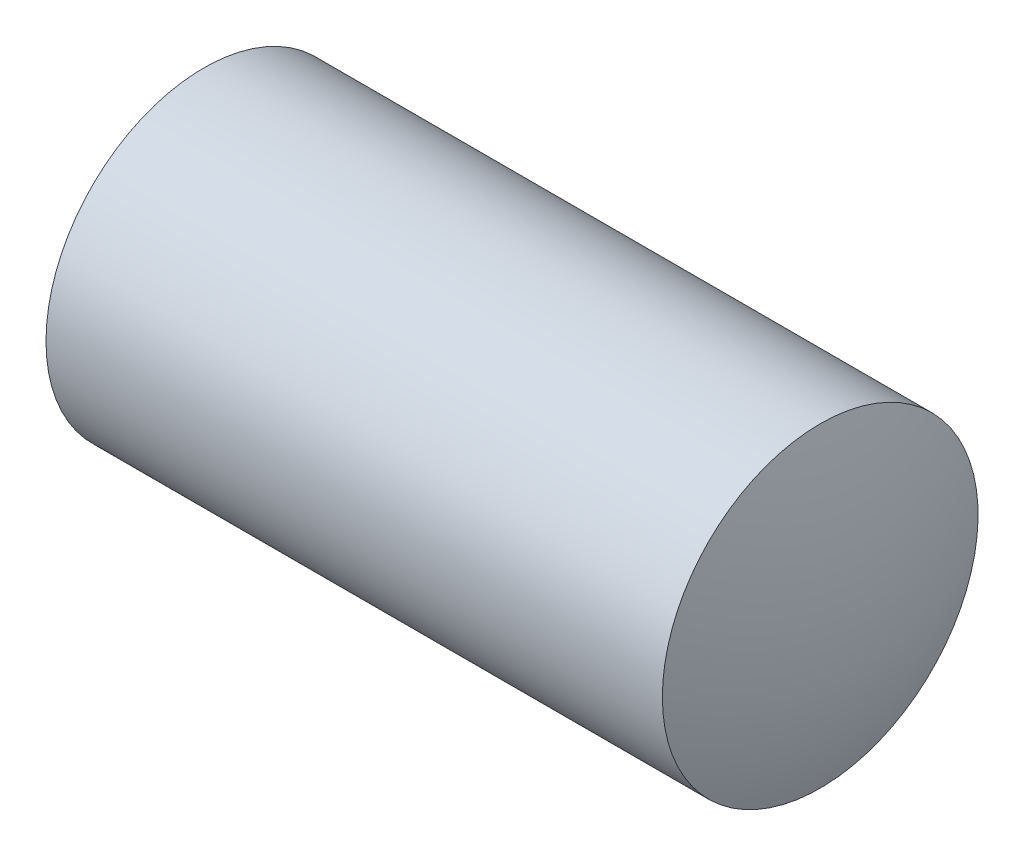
from build123d import *

# Parameters (mm, degrees)
HEX_2_DEPTH = 15


with BuildPart() as part:
    # BodySke → BaseBody (revolve)
    with BuildSketch(Plane.XY, mode=Mode.PRIVATE) as basebody_sk:
        with BuildLine():
            Line((0, 0), (0, 10.352))
            Line((0, 10.352), (0.951473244, 12))
            Line((0.951473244, 12), (47.811947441, 12))
            ThreePointArc((47.811947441, 12), (49.448514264, 6.098925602), (50, 0))
            Line((50, 0), (0, 0))
        make_face()
    revolve(basebody_sk.sketch.rotate(Axis((-12.7, 0, 0), (1, 0, 0)), 90), axis=Axis((-12.7, 0, 0), (1, 0, 0)))

    # Sketch2 → Hex 2 (cut)
    with BuildSketch(Plane.ZY):
        Polygon((3.464101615, 6), (-3.464101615, 6), (-6.92820323, 0), (-3.464101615, -6), (3.464101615, -6), (6.92820323, 0), align=None)
    extrude(amount=-HEX_2_DEPTH, mode=Mode.SUBTRACT)


solid = part.part
